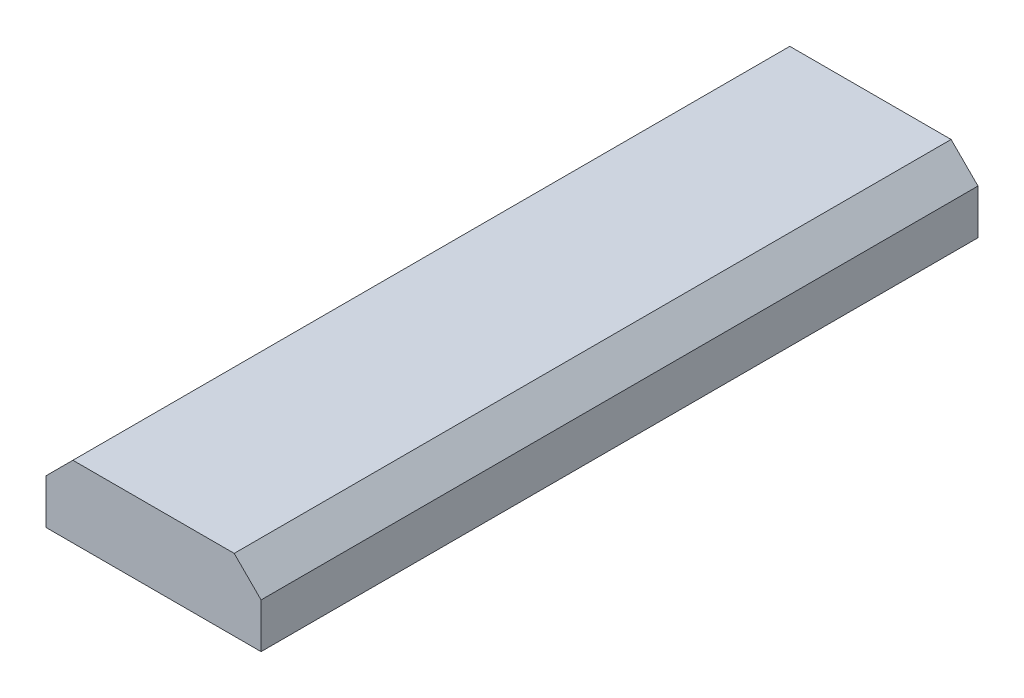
from build123d import *

# Parameters (mm, degrees)
BASE_EXTRUDE_DEPTH  = 254
SKETCH2_R           = 7.874
BOSS_EXTRUDE1_DEPTH = 9.525


with BuildPart() as part:
    # Sketch1 → Base-Extrude (new body)
    with BuildSketch(Plane.XY):
        Polygon((-38.1, 15.875), (-28.575, 25.4), (28.575, 25.4), (38.1, 15.875), (38.1, 0), (-38.1, 0), align=None)
    extrude(amount=-BASE_EXTRUDE_DEPTH)

    # Sketch2 → Boss-Extrude1 (add)
    with BuildSketch(Plane.XZ):
        with Locations(Location((0, -203.2, 0), (0, 0, 90))):
            Circle(SKETCH2_R)
    extrude(amount=BOSS_EXTRUDE1_DEPTH)


solid = part.part
